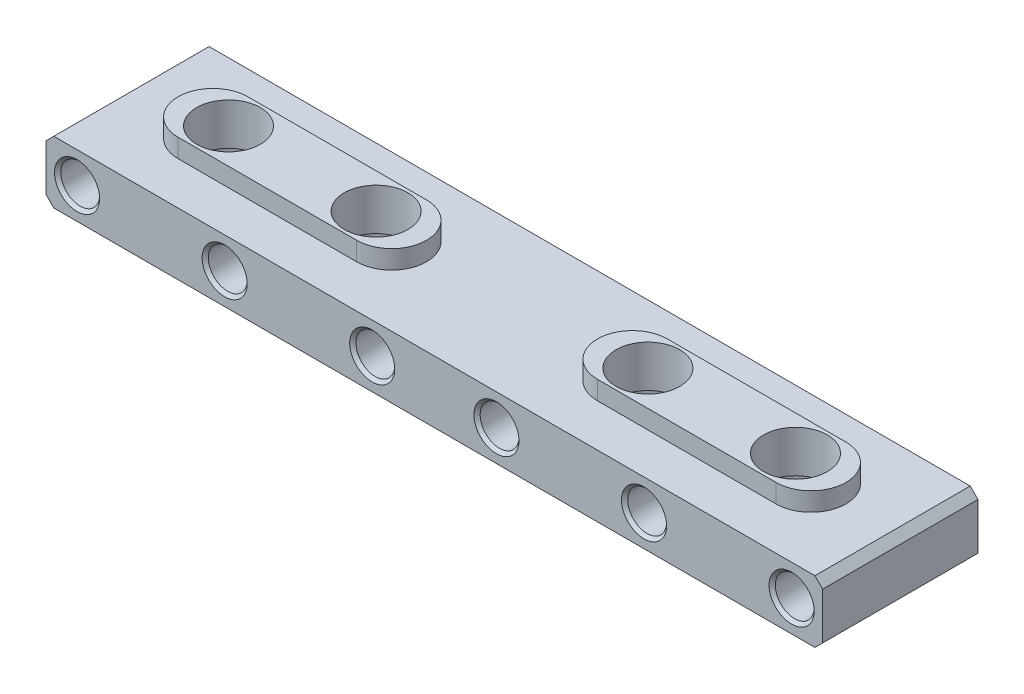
ISO-10303-21;
HEADER;
FILE_DESCRIPTION(('STEP AP214'),'2;1');
FILE_NAME('part.step','',(''),(''),'','','');
FILE_SCHEMA(('AUTOMOTIVE_DESIGN { 1 0 10303 214 1 1 1 1 }'));
ENDSEC;
DATA;
#1=APPLICATION_CONTEXT('core data for automotive mechanical design processes');
#2=APPLICATION_PROTOCOL_DEFINITION('international standard','automotive_design',2000,#1);
#3=PRODUCT_CONTEXT('',#1,'mechanical');
#4=PRODUCT('Part','Part','',(#3));
#5=PRODUCT_RELATED_PRODUCT_CATEGORY('part','',(#4));
#6=PRODUCT_DEFINITION_FORMATION('','',#4);
#7=PRODUCT_DEFINITION_CONTEXT('part definition',#1,'design');
#8=PRODUCT_DEFINITION('design','',#6,#7);
#9=PRODUCT_DEFINITION_SHAPE('','',#8);
#10=(LENGTH_UNIT() NAMED_UNIT(*) SI_UNIT(.MILLI.,.METRE.));
#11=(NAMED_UNIT(*) PLANE_ANGLE_UNIT() SI_UNIT($,.RADIAN.));
#12=(NAMED_UNIT(*) SI_UNIT($,.STERADIAN.) SOLID_ANGLE_UNIT());
#13=UNCERTAINTY_MEASURE_WITH_UNIT(LENGTH_MEASURE(1.E-05),#10,'distance_accuracy_value','');
#14=(GEOMETRIC_REPRESENTATION_CONTEXT(3) GLOBAL_UNCERTAINTY_ASSIGNED_CONTEXT((#13)) GLOBAL_UNIT_ASSIGNED_CONTEXT((#10,
#11,#12)) REPRESENTATION_CONTEXT('',''));
#15=CARTESIAN_POINT('',(0.,0.,0.));
#16=DIRECTION('',(0.,0.,1.));
#17=DIRECTION('',(1.,0.,0.));
#18=AXIS2_PLACEMENT_3D('',#15,#16,#17);
#19=CARTESIAN_POINT('',(-38.5,10.4,0.));
#20=DIRECTION('',(0.,1.,0.));
#21=DIRECTION('',(0.,0.,1.));
#22=AXIS2_PLACEMENT_3D('',#19,#20,#21);
#23=PLANE('',#22);
#24=CARTESIAN_POINT('',(-17.5,10.4,0.));
#25=DIRECTION('',(0.,-1.,0.));
#26=DIRECTION('',(0.,0.,-1.));
#27=AXIS2_PLACEMENT_3D('',#24,#25,#26);
#28=CIRCLE('',#27,4.1);
#29=CARTESIAN_POINT('',(-17.5,10.4,-4.1));
#30=VERTEX_POINT('',#29);
#31=EDGE_CURVE('E533',#30,#30,#28,.T.);
#32=ORIENTED_EDGE('',*,*,#31,.T.);
#33=EDGE_LOOP('',(#32));
#34=FACE_BOUND('',#33,.T.);
#35=CARTESIAN_POINT('',(-38.5,10.4,0.));
#36=DIRECTION('',(0.,1.,0.));
#37=DIRECTION('',(0.,0.,1.));
#38=AXIS2_PLACEMENT_3D('',#35,#36,#37);
#39=CIRCLE('',#38,4.5);
#40=CARTESIAN_POINT('',(-38.5,10.4,-4.5));
#41=VERTEX_POINT('',#40);
#42=CARTESIAN_POINT('',(-38.5,10.4,4.5));
#43=VERTEX_POINT('',#42);
#44=EDGE_CURVE('E162',#41,#43,#39,.T.);
#45=ORIENTED_EDGE('',*,*,#44,.T.);
#46=DIRECTION('',(1.,0.,0.));
#47=VECTOR('',#46,1.);
#48=CARTESIAN_POINT('',(-38.5,10.4,4.5));
#49=LINE('',#48,#47);
#50=CARTESIAN_POINT('',(-15.5,10.4,4.5));
#51=VERTEX_POINT('',#50);
#52=EDGE_CURVE('E135',#43,#51,#49,.T.);
#53=ORIENTED_EDGE('',*,*,#52,.T.);
#54=CARTESIAN_POINT('',(-15.5,10.4,0.));
#55=DIRECTION('',(0.,1.,0.));
#56=DIRECTION('',(0.,0.,1.));
#57=AXIS2_PLACEMENT_3D('',#54,#55,#56);
#58=CIRCLE('',#57,4.5);
#59=CARTESIAN_POINT('',(-15.5,10.4,-4.5));
#60=VERTEX_POINT('',#59);
#61=EDGE_CURVE('E165',#51,#60,#58,.T.);
#62=ORIENTED_EDGE('',*,*,#61,.T.);
#63=DIRECTION('',(-1.,0.,0.));
#64=VECTOR('',#63,1.);
#65=CARTESIAN_POINT('',(-38.5,10.4,-4.5));
#66=LINE('',#65,#64);
#67=EDGE_CURVE('E167',#60,#41,#66,.T.);
#68=ORIENTED_EDGE('',*,*,#67,.T.);
#69=EDGE_LOOP('',(#45,#53,#62,#68));
#70=FACE_BOUND('',#69,.T.);
#71=CARTESIAN_POINT('',(-36.5,10.4,0.));
#72=DIRECTION('',(0.,-1.,0.));
#73=DIRECTION('',(0.,0.,-1.));
#74=AXIS2_PLACEMENT_3D('',#71,#72,#73);
#75=CIRCLE('',#74,4.1);
#76=CARTESIAN_POINT('',(-36.5,10.4,-4.1));
#77=VERTEX_POINT('',#76);
#78=EDGE_CURVE('E519',#77,#77,#75,.T.);
#79=ORIENTED_EDGE('',*,*,#78,.T.);
#80=EDGE_LOOP('',(#79));
#81=FACE_BOUND('',#80,.T.);
#82=ADVANCED_FACE('F14',(#34,#70,#81),#23,.T.);
#83=CARTESIAN_POINT('',(-50.,8.,10.));
#84=DIRECTION('',(0.,1.,0.));
#85=DIRECTION('',(0.,0.,1.));
#86=AXIS2_PLACEMENT_3D('',#83,#84,#85);
#87=PLANE('',#86);
#88=DIRECTION('',(-1.,0.,0.));
#89=VECTOR('',#88,1.);
#90=CARTESIAN_POINT('',(38.5,8.,-4.5));
#91=LINE('',#90,#89);
#92=CARTESIAN_POINT('',(38.5,8.,-4.5));
#93=VERTEX_POINT('',#92);
#94=CARTESIAN_POINT('',(15.5,8.,-4.5));
#95=VERTEX_POINT('',#94);
#96=EDGE_CURVE('E175',#93,#95,#91,.T.);
#97=ORIENTED_EDGE('',*,*,#96,.F.);
#98=CARTESIAN_POINT('',(38.5,8.,0.));
#99=DIRECTION('',(0.,1.,0.));
#100=DIRECTION('',(0.,0.,-1.));
#101=AXIS2_PLACEMENT_3D('',#98,#99,#100);
#102=CIRCLE('',#101,4.5);
#103=CARTESIAN_POINT('',(38.5,8.,4.5));
#104=VERTEX_POINT('',#103);
#105=EDGE_CURVE('E139',#104,#93,#102,.T.);
#106=ORIENTED_EDGE('',*,*,#105,.F.);
#107=DIRECTION('',(1.,0.,0.));
#108=VECTOR('',#107,1.);
#109=CARTESIAN_POINT('',(38.5,8.,4.5));
#110=LINE('',#109,#108);
#111=CARTESIAN_POINT('',(15.5,8.,4.5));
#112=VERTEX_POINT('',#111);
#113=EDGE_CURVE('E180',#112,#104,#110,.T.);
#114=ORIENTED_EDGE('',*,*,#113,.F.);
#115=CARTESIAN_POINT('',(15.5,8.,0.));
#116=DIRECTION('',(0.,1.,0.));
#117=DIRECTION('',(0.,0.,-1.));
#118=AXIS2_PLACEMENT_3D('',#115,#116,#117);
#119=CIRCLE('',#118,4.5);
#120=EDGE_CURVE('E177',#95,#112,#119,.T.);
#121=ORIENTED_EDGE('',*,*,#120,.F.);
#122=EDGE_LOOP('',(#97,#106,#114,#121));
#123=FACE_BOUND('',#122,.T.);
#124=DIRECTION('',(-1.,0.,0.));
#125=VECTOR('',#124,1.);
#126=CARTESIAN_POINT('',(-50.,8.,-10.));
#127=LINE('',#126,#125);
#128=CARTESIAN_POINT('',(49.,8.,-10.));
#129=VERTEX_POINT('',#128);
#130=CARTESIAN_POINT('',(-49.,8.,-10.));
#131=VERTEX_POINT('',#130);
#132=EDGE_CURVE('E210',#129,#131,#127,.T.);
#133=ORIENTED_EDGE('',*,*,#132,.T.);
#134=DIRECTION('',(0.,0.,1.));
#135=VECTOR('',#134,1.);
#136=CARTESIAN_POINT('',(-49.,8.,10.));
#137=LINE('',#136,#135);
#138=CARTESIAN_POINT('',(-49.,8.,10.));
#139=VERTEX_POINT('',#138);
#140=EDGE_CURVE('E250',#131,#139,#137,.T.);
#141=ORIENTED_EDGE('',*,*,#140,.T.);
#142=DIRECTION('',(1.,0.,0.));
#143=VECTOR('',#142,1.);
#144=CARTESIAN_POINT('',(-50.,8.,10.));
#145=LINE('',#144,#143);
#146=CARTESIAN_POINT('',(49.,8.,10.));
#147=VERTEX_POINT('',#146);
#148=EDGE_CURVE('E207',#139,#147,#145,.T.);
#149=ORIENTED_EDGE('',*,*,#148,.T.);
#150=DIRECTION('',(0.,0.,-1.));
#151=VECTOR('',#150,1.);
#152=CARTESIAN_POINT('',(49.,8.,-10.));
#153=LINE('',#152,#151);
#154=EDGE_CURVE('E247',#147,#129,#153,.T.);
#155=ORIENTED_EDGE('',*,*,#154,.T.);
#156=EDGE_LOOP('',(#133,#141,#149,#155));
#157=FACE_BOUND('',#156,.T.);
#158=DIRECTION('',(1.,0.,0.));
#159=VECTOR('',#158,1.);
#160=CARTESIAN_POINT('',(-38.5,8.,4.5));
#161=LINE('',#160,#159);
#162=CARTESIAN_POINT('',(-38.5,8.,4.5));
#163=VERTEX_POINT('',#162);
#164=CARTESIAN_POINT('',(-15.5,8.,4.5));
#165=VERTEX_POINT('',#164);
#166=EDGE_CURVE('E133',#163,#165,#161,.T.);
#167=ORIENTED_EDGE('',*,*,#166,.F.);
#168=CARTESIAN_POINT('',(-38.5,8.,0.));
#169=DIRECTION('',(0.,1.,0.));
#170=DIRECTION('',(0.,0.,1.));
#171=AXIS2_PLACEMENT_3D('',#168,#169,#170);
#172=CIRCLE('',#171,4.5);
#173=CARTESIAN_POINT('',(-38.5,8.,-4.5));
#174=VERTEX_POINT('',#173);
#175=EDGE_CURVE('E144',#174,#163,#172,.T.);
#176=ORIENTED_EDGE('',*,*,#175,.F.);
#177=DIRECTION('',(-1.,0.,0.));
#178=VECTOR('',#177,1.);
#179=CARTESIAN_POINT('',(-38.5,8.,-4.5));
#180=LINE('',#179,#178);
#181=CARTESIAN_POINT('',(-15.5,8.,-4.5));
#182=VERTEX_POINT('',#181);
#183=EDGE_CURVE('E157',#182,#174,#180,.T.);
#184=ORIENTED_EDGE('',*,*,#183,.F.);
#185=CARTESIAN_POINT('',(-15.5,8.,0.));
#186=DIRECTION('',(0.,1.,0.));
#187=DIRECTION('',(0.,0.,1.));
#188=AXIS2_PLACEMENT_3D('',#185,#186,#187);
#189=CIRCLE('',#188,4.5);
#190=EDGE_CURVE('E155',#165,#182,#189,.T.);
#191=ORIENTED_EDGE('',*,*,#190,.F.);
#192=EDGE_LOOP('',(#167,#176,#184,#191));
#193=FACE_BOUND('',#192,.T.);
#194=ADVANCED_FACE('F153',(#123,#157,#193),#87,.T.);
#195=CARTESIAN_POINT('',(-50.,8.,-10.));
#196=DIRECTION('',(1.,0.,0.));
#197=DIRECTION('',(0.,0.,-1.));
#198=AXIS2_PLACEMENT_3D('',#195,#196,#197);
#199=PLANE('',#198);
#200=DIRECTION('',(0.,-1.,0.));
#201=VECTOR('',#200,1.);
#202=CARTESIAN_POINT('',(-50.,8.,-10.));
#203=LINE('',#202,#201);
#204=CARTESIAN_POINT('',(-50.,7.,-10.));
#205=VERTEX_POINT('',#204);
#206=CARTESIAN_POINT('',(-50.,1.00000000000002,-10.));
#207=VERTEX_POINT('',#206);
#208=EDGE_CURVE('E213',#205,#207,#203,.T.);
#209=ORIENTED_EDGE('',*,*,#208,.T.);
#210=DIRECTION('',(0.,0.,1.));
#211=VECTOR('',#210,1.);
#212=CARTESIAN_POINT('',(-50.,1.00000000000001,-10.));
#213=LINE('',#212,#211);
#214=CARTESIAN_POINT('',(-50.,1.00000000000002,10.));
#215=VERTEX_POINT('',#214);
#216=EDGE_CURVE('E226',#207,#215,#213,.T.);
#217=ORIENTED_EDGE('',*,*,#216,.T.);
#218=DIRECTION('',(0.,-1.,0.));
#219=VECTOR('',#218,1.);
#220=CARTESIAN_POINT('',(-50.,8.,10.));
#221=LINE('',#220,#219);
#222=CARTESIAN_POINT('',(-50.,7.,10.));
#223=VERTEX_POINT('',#222);
#224=EDGE_CURVE('E221',#223,#215,#221,.T.);
#225=ORIENTED_EDGE('',*,*,#224,.F.);
#226=DIRECTION('',(0.,0.,-1.));
#227=VECTOR('',#226,1.);
#228=CARTESIAN_POINT('',(-50.,7.,-10.));
#229=LINE('',#228,#227);
#230=EDGE_CURVE('E224',#223,#205,#229,.T.);
#231=ORIENTED_EDGE('',*,*,#230,.T.);
#232=EDGE_LOOP('',(#209,#217,#225,#231));
#233=FACE_BOUND('',#232,.T.);
#234=ADVANCED_FACE('F16',(#233),#199,.F.);
#235=CARTESIAN_POINT('',(-50.,8.,10.));
#236=DIRECTION('',(0.,0.,-1.));
#237=DIRECTION('',(-1.,0.,0.));
#238=AXIS2_PLACEMENT_3D('',#235,#236,#237);
#239=PLANE('',#238);
#240=CARTESIAN_POINT('',(-46.,4.,10.));
#241=DIRECTION('',(0.,0.,-1.));
#242=DIRECTION('',(-1.,0.,0.));
#243=AXIS2_PLACEMENT_3D('',#240,#241,#242);
#244=CIRCLE('',#243,2.9);
#245=CARTESIAN_POINT('',(-48.9,4.,10.));
#246=VERTEX_POINT('',#245);
#247=EDGE_CURVE('E272',#246,#246,#244,.T.);
#248=ORIENTED_EDGE('',*,*,#247,.T.);
#249=EDGE_LOOP('',(#248));
#250=FACE_BOUND('',#249,.T.);
#251=CARTESIAN_POINT('',(-27.,4.,10.));
#252=DIRECTION('',(0.,0.,-1.));
#253=DIRECTION('',(-1.,0.,0.));
#254=AXIS2_PLACEMENT_3D('',#251,#252,#253);
#255=CIRCLE('',#254,2.9);
#256=CARTESIAN_POINT('',(-29.9,4.,10.));
#257=VERTEX_POINT('',#256);
#258=EDGE_CURVE('E269',#257,#257,#255,.T.);
#259=ORIENTED_EDGE('',*,*,#258,.T.);
#260=EDGE_LOOP('',(#259));
#261=FACE_BOUND('',#260,.T.);
#262=CARTESIAN_POINT('',(-8.,4.,10.));
#263=DIRECTION('',(0.,0.,-1.));
#264=DIRECTION('',(-1.,0.,0.));
#265=AXIS2_PLACEMENT_3D('',#262,#263,#264);
#266=CIRCLE('',#265,2.9);
#267=CARTESIAN_POINT('',(-10.9,4.,10.));
#268=VERTEX_POINT('',#267);
#269=EDGE_CURVE('E266',#268,#268,#266,.T.);
#270=ORIENTED_EDGE('',*,*,#269,.T.);
#271=EDGE_LOOP('',(#270));
#272=FACE_BOUND('',#271,.T.);
#273=CARTESIAN_POINT('',(8.,4.,10.));
#274=DIRECTION('',(0.,0.,-1.));
#275=DIRECTION('',(-1.,0.,0.));
#276=AXIS2_PLACEMENT_3D('',#273,#274,#275);
#277=CIRCLE('',#276,2.9);
#278=CARTESIAN_POINT('',(5.1,4.,10.));
#279=VERTEX_POINT('',#278);
#280=EDGE_CURVE('E263',#279,#279,#277,.T.);
#281=ORIENTED_EDGE('',*,*,#280,.T.);
#282=EDGE_LOOP('',(#281));
#283=FACE_BOUND('',#282,.T.);
#284=CARTESIAN_POINT('',(27.,4.,10.));
#285=DIRECTION('',(0.,0.,-1.));
#286=DIRECTION('',(-1.,0.,0.));
#287=AXIS2_PLACEMENT_3D('',#284,#285,#286);
#288=CIRCLE('',#287,2.9);
#289=CARTESIAN_POINT('',(24.1,4.,10.));
#290=VERTEX_POINT('',#289);
#291=EDGE_CURVE('E260',#290,#290,#288,.T.);
#292=ORIENTED_EDGE('',*,*,#291,.T.);
#293=EDGE_LOOP('',(#292));
#294=FACE_BOUND('',#293,.T.);
#295=CARTESIAN_POINT('',(46.,4.,10.));
#296=DIRECTION('',(0.,0.,-1.));
#297=DIRECTION('',(-1.,0.,0.));
#298=AXIS2_PLACEMENT_3D('',#295,#296,#297);
#299=CIRCLE('',#298,2.9);
#300=CARTESIAN_POINT('',(43.1,4.,10.));
#301=VERTEX_POINT('',#300);
#302=EDGE_CURVE('E257',#301,#301,#299,.T.);
#303=ORIENTED_EDGE('',*,*,#302,.T.);
#304=EDGE_LOOP('',(#303));
#305=FACE_BOUND('',#304,.T.);
#306=ORIENTED_EDGE('',*,*,#224,.T.);
#307=DIRECTION('',(-0.707106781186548,0.707106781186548,0.));
#308=VECTOR('',#307,1.);
#309=CARTESIAN_POINT('',(-50.,1.00000000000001,10.));
#310=LINE('',#309,#308);
#311=CARTESIAN_POINT('',(-49.,0.,10.));
#312=VERTEX_POINT('',#311);
#313=EDGE_CURVE('E235',#215,#312,#310,.F.);
#314=ORIENTED_EDGE('',*,*,#313,.T.);
#315=DIRECTION('',(1.,0.,0.));
#316=VECTOR('',#315,1.);
#317=CARTESIAN_POINT('',(-50.,0.,10.));
#318=LINE('',#317,#316);
#319=CARTESIAN_POINT('',(49.,0.,10.));
#320=VERTEX_POINT('',#319);
#321=EDGE_CURVE('E201',#312,#320,#318,.T.);
#322=ORIENTED_EDGE('',*,*,#321,.T.);
#323=DIRECTION('',(-0.707106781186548,-0.707106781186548,0.));
#324=VECTOR('',#323,1.);
#325=CARTESIAN_POINT('',(50.,1.00000000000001,10.));
#326=LINE('',#325,#324);
#327=CARTESIAN_POINT('',(50.,1.00000000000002,10.));
#328=VERTEX_POINT('',#327);
#329=EDGE_CURVE('E231',#320,#328,#326,.F.);
#330=ORIENTED_EDGE('',*,*,#329,.T.);
#331=DIRECTION('',(0.,-1.,0.));
#332=VECTOR('',#331,1.);
#333=CARTESIAN_POINT('',(50.,8.,10.));
#334=LINE('',#333,#332);
#335=CARTESIAN_POINT('',(50.,7.,10.));
#336=VERTEX_POINT('',#335);
#337=EDGE_CURVE('E218',#336,#328,#334,.T.);
#338=ORIENTED_EDGE('',*,*,#337,.F.);
#339=DIRECTION('',(-0.707106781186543,0.707106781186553,0.));
#340=VECTOR('',#339,1.);
#341=CARTESIAN_POINT('',(49.,8.,10.));
#342=LINE('',#341,#340);
#343=EDGE_CURVE('E229',#336,#147,#342,.T.);
#344=ORIENTED_EDGE('',*,*,#343,.T.);
#345=ORIENTED_EDGE('',*,*,#148,.F.);
#346=DIRECTION('',(-0.707106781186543,-0.707106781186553,0.));
#347=VECTOR('',#346,1.);
#348=CARTESIAN_POINT('',(-49.,8.,10.));
#349=LINE('',#348,#347);
#350=EDGE_CURVE('E233',#139,#223,#349,.T.);
#351=ORIENTED_EDGE('',*,*,#350,.T.);
#352=EDGE_LOOP('',(#306,#314,#322,#330,#338,#344,#345,#351));
#353=FACE_BOUND('',#352,.T.);
#354=ADVANCED_FACE('F424',(#250,#261,#272,#283,#294,#305,#353),#239,.F.);
#355=CARTESIAN_POINT('',(50.,8.,-10.));
#356=DIRECTION('',(-1.,0.,0.));
#357=DIRECTION('',(0.,0.,1.));
#358=AXIS2_PLACEMENT_3D('',#355,#356,#357);
#359=PLANE('',#358);
#360=ORIENTED_EDGE('',*,*,#337,.T.);
#361=DIRECTION('',(0.,0.,-1.));
#362=VECTOR('',#361,1.);
#363=CARTESIAN_POINT('',(50.,1.00000000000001,-10.));
#364=LINE('',#363,#362);
#365=CARTESIAN_POINT('',(50.,1.00000000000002,-10.));
#366=VERTEX_POINT('',#365);
#367=EDGE_CURVE('E255',#328,#366,#364,.T.);
#368=ORIENTED_EDGE('',*,*,#367,.T.);
#369=DIRECTION('',(0.,-1.,0.));
#370=VECTOR('',#369,1.);
#371=CARTESIAN_POINT('',(50.,8.,-10.));
#372=LINE('',#371,#370);
#373=CARTESIAN_POINT('',(50.,7.,-10.));
#374=VERTEX_POINT('',#373);
#375=EDGE_CURVE('E216',#374,#366,#372,.T.);
#376=ORIENTED_EDGE('',*,*,#375,.F.);
#377=DIRECTION('',(0.,0.,1.));
#378=VECTOR('',#377,1.);
#379=CARTESIAN_POINT('',(50.,7.,10.));
#380=LINE('',#379,#378);
#381=EDGE_CURVE('E253',#374,#336,#380,.T.);
#382=ORIENTED_EDGE('',*,*,#381,.T.);
#383=EDGE_LOOP('',(#360,#368,#376,#382));
#384=FACE_BOUND('',#383,.T.);
#385=ADVANCED_FACE('F441',(#384),#359,.F.);
#386=CARTESIAN_POINT('',(-50.,8.,-10.));
#387=DIRECTION('',(0.,0.,1.));
#388=DIRECTION('',(1.,0.,0.));
#389=AXIS2_PLACEMENT_3D('',#386,#387,#388);
#390=PLANE('',#389);
#391=CARTESIAN_POINT('',(46.,4.,-10.));
#392=DIRECTION('',(0.,0.,1.));
#393=DIRECTION('',(1.,0.,0.));
#394=AXIS2_PLACEMENT_3D('',#391,#392,#393);
#395=CIRCLE('',#394,2.9);
#396=CARTESIAN_POINT('',(48.9,4.,-10.));
#397=VERTEX_POINT('',#396);
#398=EDGE_CURVE('E9',#397,#397,#395,.T.);
#399=ORIENTED_EDGE('',*,*,#398,.T.);
#400=EDGE_LOOP('',(#399));
#401=FACE_BOUND('',#400,.T.);
#402=CARTESIAN_POINT('',(27.,4.,-10.));
#403=DIRECTION('',(0.,0.,1.));
#404=DIRECTION('',(1.,0.,0.));
#405=AXIS2_PLACEMENT_3D('',#402,#403,#404);
#406=CIRCLE('',#405,2.9);
#407=CARTESIAN_POINT('',(29.9,4.,-10.));
#408=VERTEX_POINT('',#407);
#409=EDGE_CURVE('E22',#408,#408,#406,.T.);
#410=ORIENTED_EDGE('',*,*,#409,.T.);
#411=EDGE_LOOP('',(#410));
#412=FACE_BOUND('',#411,.T.);
#413=CARTESIAN_POINT('',(8.,4.,-10.));
#414=DIRECTION('',(0.,0.,1.));
#415=DIRECTION('',(1.,0.,0.));
#416=AXIS2_PLACEMENT_3D('',#413,#414,#415);
#417=CIRCLE('',#416,2.9);
#418=CARTESIAN_POINT('',(10.9,4.,-10.));
#419=VERTEX_POINT('',#418);
#420=EDGE_CURVE('E320',#419,#419,#417,.T.);
#421=ORIENTED_EDGE('',*,*,#420,.T.);
#422=EDGE_LOOP('',(#421));
#423=FACE_BOUND('',#422,.T.);
#424=CARTESIAN_POINT('',(-8.,4.,-10.));
#425=DIRECTION('',(0.,0.,1.));
#426=DIRECTION('',(1.,0.,0.));
#427=AXIS2_PLACEMENT_3D('',#424,#425,#426);
#428=CIRCLE('',#427,2.9);
#429=CARTESIAN_POINT('',(-5.1,4.,-10.));
#430=VERTEX_POINT('',#429);
#431=EDGE_CURVE('E317',#430,#430,#428,.T.);
#432=ORIENTED_EDGE('',*,*,#431,.T.);
#433=EDGE_LOOP('',(#432));
#434=FACE_BOUND('',#433,.T.);
#435=CARTESIAN_POINT('',(-27.,4.,-10.));
#436=DIRECTION('',(0.,0.,1.));
#437=DIRECTION('',(1.,0.,0.));
#438=AXIS2_PLACEMENT_3D('',#435,#436,#437);
#439=CIRCLE('',#438,2.9);
#440=CARTESIAN_POINT('',(-24.1,4.,-10.));
#441=VERTEX_POINT('',#440);
#442=EDGE_CURVE('E314',#441,#441,#439,.T.);
#443=ORIENTED_EDGE('',*,*,#442,.T.);
#444=EDGE_LOOP('',(#443));
#445=FACE_BOUND('',#444,.T.);
#446=CARTESIAN_POINT('',(-46.,4.,-10.));
#447=DIRECTION('',(0.,0.,1.));
#448=DIRECTION('',(1.,0.,0.));
#449=AXIS2_PLACEMENT_3D('',#446,#447,#448);
#450=CIRCLE('',#449,2.9);
#451=CARTESIAN_POINT('',(-43.1,4.,-10.));
#452=VERTEX_POINT('',#451);
#453=EDGE_CURVE('E311',#452,#452,#450,.T.);
#454=ORIENTED_EDGE('',*,*,#453,.T.);
#455=EDGE_LOOP('',(#454));
#456=FACE_BOUND('',#455,.T.);
#457=DIRECTION('',(-1.,0.,0.));
#458=VECTOR('',#457,1.);
#459=CARTESIAN_POINT('',(-50.,0.,-10.));
#460=LINE('',#459,#458);
#461=CARTESIAN_POINT('',(49.,0.,-10.));
#462=VERTEX_POINT('',#461);
#463=CARTESIAN_POINT('',(-49.,0.,-10.));
#464=VERTEX_POINT('',#463);
#465=EDGE_CURVE('E204',#462,#464,#460,.T.);
#466=ORIENTED_EDGE('',*,*,#465,.T.);
#467=DIRECTION('',(0.707106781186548,-0.707106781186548,0.));
#468=VECTOR('',#467,1.);
#469=CARTESIAN_POINT('',(-50.,1.00000000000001,-10.));
#470=LINE('',#469,#468);
#471=EDGE_CURVE('E245',#464,#207,#470,.F.);
#472=ORIENTED_EDGE('',*,*,#471,.T.);
#473=ORIENTED_EDGE('',*,*,#208,.F.);
#474=DIRECTION('',(0.707106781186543,0.707106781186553,0.));
#475=VECTOR('',#474,1.);
#476=CARTESIAN_POINT('',(-49.,8.,-10.));
#477=LINE('',#476,#475);
#478=EDGE_CURVE('E243',#205,#131,#477,.T.);
#479=ORIENTED_EDGE('',*,*,#478,.T.);
#480=ORIENTED_EDGE('',*,*,#132,.F.);
#481=DIRECTION('',(0.707106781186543,-0.707106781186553,0.));
#482=VECTOR('',#481,1.);
#483=CARTESIAN_POINT('',(49.,8.,-10.));
#484=LINE('',#483,#482);
#485=EDGE_CURVE('E37',#129,#374,#484,.T.);
#486=ORIENTED_EDGE('',*,*,#485,.T.);
#487=ORIENTED_EDGE('',*,*,#375,.T.);
#488=DIRECTION('',(0.707106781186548,0.707106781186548,0.));
#489=VECTOR('',#488,1.);
#490=CARTESIAN_POINT('',(50.,1.00000000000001,-10.));
#491=LINE('',#490,#489);
#492=EDGE_CURVE('E29',#366,#462,#491,.F.);
#493=ORIENTED_EDGE('',*,*,#492,.T.);
#494=EDGE_LOOP('',(#466,#472,#473,#479,#480,#486,#487,#493));
#495=FACE_BOUND('',#494,.T.);
#496=ADVANCED_FACE('F325',(#401,#412,#423,#434,#445,#456,#495),#390,.F.);
#497=CARTESIAN_POINT('',(-50.,0.,10.));
#498=DIRECTION('',(0.,1.,0.));
#499=DIRECTION('',(0.,0.,1.));
#500=AXIS2_PLACEMENT_3D('',#497,#498,#499);
#501=PLANE('',#500);
#502=CARTESIAN_POINT('',(36.5,0.,0.));
#503=DIRECTION('',(0.,-1.,0.));
#504=DIRECTION('',(0.,0.,-1.));
#505=AXIS2_PLACEMENT_3D('',#502,#503,#504);
#506=CIRCLE('',#505,6.75);
#507=CARTESIAN_POINT('',(36.5,0.,-6.75));
#508=VERTEX_POINT('',#507);
#509=EDGE_CURVE('E547',#508,#508,#506,.T.);
#510=ORIENTED_EDGE('',*,*,#509,.F.);
#511=EDGE_LOOP('',(#510));
#512=FACE_BOUND('',#511,.T.);
#513=CARTESIAN_POINT('',(17.5,0.,0.));
#514=DIRECTION('',(0.,-1.,0.));
#515=DIRECTION('',(0.,0.,-1.));
#516=AXIS2_PLACEMENT_3D('',#513,#514,#515);
#517=CIRCLE('',#516,6.75);
#518=CARTESIAN_POINT('',(17.5,0.,-6.75));
#519=VERTEX_POINT('',#518);
#520=EDGE_CURVE('E535',#519,#519,#517,.T.);
#521=ORIENTED_EDGE('',*,*,#520,.F.);
#522=EDGE_LOOP('',(#521));
#523=FACE_BOUND('',#522,.T.);
#524=CARTESIAN_POINT('',(-17.5,0.,0.));
#525=DIRECTION('',(0.,-1.,0.));
#526=DIRECTION('',(0.,0.,-1.));
#527=AXIS2_PLACEMENT_3D('',#524,#525,#526);
#528=CIRCLE('',#527,6.75);
#529=CARTESIAN_POINT('',(-17.5,0.,-6.75));
#530=VERTEX_POINT('',#529);
#531=EDGE_CURVE('E524',#530,#530,#528,.T.);
#532=ORIENTED_EDGE('',*,*,#531,.F.);
#533=EDGE_LOOP('',(#532));
#534=FACE_BOUND('',#533,.T.);
#535=CARTESIAN_POINT('',(-36.5,0.,0.));
#536=DIRECTION('',(0.,-1.,0.));
#537=DIRECTION('',(0.,0.,-1.));
#538=AXIS2_PLACEMENT_3D('',#535,#536,#537);
#539=CIRCLE('',#538,6.75);
#540=CARTESIAN_POINT('',(-36.5,0.,-6.75));
#541=VERTEX_POINT('',#540);
#542=EDGE_CURVE('E150',#541,#541,#539,.T.);
#543=ORIENTED_EDGE('',*,*,#542,.F.);
#544=EDGE_LOOP('',(#543));
#545=FACE_BOUND('',#544,.T.);
#546=ORIENTED_EDGE('',*,*,#321,.F.);
#547=DIRECTION('',(0.,0.,-1.));
#548=VECTOR('',#547,1.);
#549=CARTESIAN_POINT('',(-49.,0.,10.));
#550=LINE('',#549,#548);
#551=EDGE_CURVE('E239',#312,#464,#550,.T.);
#552=ORIENTED_EDGE('',*,*,#551,.T.);
#553=ORIENTED_EDGE('',*,*,#465,.F.);
#554=DIRECTION('',(0.,0.,1.));
#555=VECTOR('',#554,1.);
#556=CARTESIAN_POINT('',(49.,0.,10.));
#557=LINE('',#556,#555);
#558=EDGE_CURVE('E237',#462,#320,#557,.T.);
#559=ORIENTED_EDGE('',*,*,#558,.T.);
#560=EDGE_LOOP('',(#546,#552,#553,#559));
#561=FACE_BOUND('',#560,.T.);
#562=ADVANCED_FACE('F435',(#512,#523,#534,#545,#561),#501,.F.);
#563=CARTESIAN_POINT('',(-46.,4.,-10.));
#564=DIRECTION('',(0.,0.,-1.));
#565=DIRECTION('',(-1.,0.,0.));
#566=AXIS2_PLACEMENT_3D('',#563,#564,#565);
#567=CYLINDRICAL_SURFACE('',#566,2.5);
#568=CARTESIAN_POINT('',(-46.,4.,9.6));
#569=DIRECTION('',(0.,0.,-1.));
#570=DIRECTION('',(-1.,0.,0.));
#571=AXIS2_PLACEMENT_3D('',#568,#569,#570);
#572=CIRCLE('',#571,2.5);
#573=CARTESIAN_POINT('',(-48.5,4.,9.6));
#574=VERTEX_POINT('',#573);
#575=EDGE_CURVE('E278',#574,#574,#572,.F.);
#576=ORIENTED_EDGE('',*,*,#575,.T.);
#577=EDGE_LOOP('',(#576));
#578=FACE_BOUND('',#577,.T.);
#579=CARTESIAN_POINT('',(-46.,4.,-9.6));
#580=DIRECTION('',(0.,0.,1.));
#581=DIRECTION('',(1.,0.,0.));
#582=AXIS2_PLACEMENT_3D('',#579,#580,#581);
#583=CIRCLE('',#582,2.5);
#584=CARTESIAN_POINT('',(-43.5,4.,-9.6));
#585=VERTEX_POINT('',#584);
#586=EDGE_CURVE('E275',#585,#585,#583,.F.);
#587=ORIENTED_EDGE('',*,*,#586,.T.);
#588=EDGE_LOOP('',(#587));
#589=FACE_BOUND('',#588,.T.);
#590=ADVANCED_FACE('F569',(#578,#589),#567,.F.);
#591=CARTESIAN_POINT('',(-27.,4.,-10.));
#592=DIRECTION('',(0.,0.,-1.));
#593=DIRECTION('',(-1.,0.,0.));
#594=AXIS2_PLACEMENT_3D('',#591,#592,#593);
#595=CYLINDRICAL_SURFACE('',#594,2.5);
#596=CARTESIAN_POINT('',(-27.,4.,9.6));
#597=DIRECTION('',(0.,0.,-1.));
#598=DIRECTION('',(-1.,0.,0.));
#599=AXIS2_PLACEMENT_3D('',#596,#597,#598);
#600=CIRCLE('',#599,2.5);
#601=CARTESIAN_POINT('',(-29.5,4.,9.6));
#602=VERTEX_POINT('',#601);
#603=EDGE_CURVE('E284',#602,#602,#600,.F.);
#604=ORIENTED_EDGE('',*,*,#603,.T.);
#605=EDGE_LOOP('',(#604));
#606=FACE_BOUND('',#605,.T.);
#607=CARTESIAN_POINT('',(-27.,4.,-9.6));
#608=DIRECTION('',(0.,0.,1.));
#609=DIRECTION('',(1.,0.,0.));
#610=AXIS2_PLACEMENT_3D('',#607,#608,#609);
#611=CIRCLE('',#610,2.5);
#612=CARTESIAN_POINT('',(-24.5,4.,-9.6));
#613=VERTEX_POINT('',#612);
#614=EDGE_CURVE('E281',#613,#613,#611,.F.);
#615=ORIENTED_EDGE('',*,*,#614,.T.);
#616=EDGE_LOOP('',(#615));
#617=FACE_BOUND('',#616,.T.);
#618=ADVANCED_FACE('F584',(#606,#617),#595,.F.);
#619=CARTESIAN_POINT('',(-8.,4.,-10.));
#620=DIRECTION('',(0.,0.,-1.));
#621=DIRECTION('',(-1.,0.,0.));
#622=AXIS2_PLACEMENT_3D('',#619,#620,#621);
#623=CYLINDRICAL_SURFACE('',#622,2.5);
#624=CARTESIAN_POINT('',(-8.,4.,9.6));
#625=DIRECTION('',(0.,0.,-1.));
#626=DIRECTION('',(-1.,0.,0.));
#627=AXIS2_PLACEMENT_3D('',#624,#625,#626);
#628=CIRCLE('',#627,2.5);
#629=CARTESIAN_POINT('',(-10.5,4.,9.6));
#630=VERTEX_POINT('',#629);
#631=EDGE_CURVE('E290',#630,#630,#628,.F.);
#632=ORIENTED_EDGE('',*,*,#631,.T.);
#633=EDGE_LOOP('',(#632));
#634=FACE_BOUND('',#633,.T.);
#635=CARTESIAN_POINT('',(-8.,4.,-9.6));
#636=DIRECTION('',(0.,0.,1.));
#637=DIRECTION('',(1.,0.,0.));
#638=AXIS2_PLACEMENT_3D('',#635,#636,#637);
#639=CIRCLE('',#638,2.5);
#640=CARTESIAN_POINT('',(-5.5,4.,-9.6));
#641=VERTEX_POINT('',#640);
#642=EDGE_CURVE('E287',#641,#641,#639,.F.);
#643=ORIENTED_EDGE('',*,*,#642,.T.);
#644=EDGE_LOOP('',(#643));
#645=FACE_BOUND('',#644,.T.);
#646=ADVANCED_FACE('F351',(#634,#645),#623,.F.);
#647=CARTESIAN_POINT('',(8.,4.,-10.));
#648=DIRECTION('',(0.,0.,-1.));
#649=DIRECTION('',(-1.,0.,0.));
#650=AXIS2_PLACEMENT_3D('',#647,#648,#649);
#651=CYLINDRICAL_SURFACE('',#650,2.5);
#652=CARTESIAN_POINT('',(8.,4.,9.6));
#653=DIRECTION('',(0.,0.,-1.));
#654=DIRECTION('',(-1.,0.,0.));
#655=AXIS2_PLACEMENT_3D('',#652,#653,#654);
#656=CIRCLE('',#655,2.5);
#657=CARTESIAN_POINT('',(5.5,4.,9.6));
#658=VERTEX_POINT('',#657);
#659=EDGE_CURVE('E296',#658,#658,#656,.F.);
#660=ORIENTED_EDGE('',*,*,#659,.T.);
#661=EDGE_LOOP('',(#660));
#662=FACE_BOUND('',#661,.T.);
#663=CARTESIAN_POINT('',(8.,4.,-9.6));
#664=DIRECTION('',(0.,0.,1.));
#665=DIRECTION('',(1.,0.,0.));
#666=AXIS2_PLACEMENT_3D('',#663,#664,#665);
#667=CIRCLE('',#666,2.5);
#668=CARTESIAN_POINT('',(10.5,4.,-9.6));
#669=VERTEX_POINT('',#668);
#670=EDGE_CURVE('E293',#669,#669,#667,.F.);
#671=ORIENTED_EDGE('',*,*,#670,.T.);
#672=EDGE_LOOP('',(#671));
#673=FACE_BOUND('',#672,.T.);
#674=ADVANCED_FACE('F339',(#662,#673),#651,.F.);
#675=CARTESIAN_POINT('',(27.,4.,-10.));
#676=DIRECTION('',(0.,0.,-1.));
#677=DIRECTION('',(-1.,0.,0.));
#678=AXIS2_PLACEMENT_3D('',#675,#676,#677);
#679=CYLINDRICAL_SURFACE('',#678,2.5);
#680=CARTESIAN_POINT('',(27.,4.,9.6));
#681=DIRECTION('',(0.,0.,-1.));
#682=DIRECTION('',(-1.,0.,0.));
#683=AXIS2_PLACEMENT_3D('',#680,#681,#682);
#684=CIRCLE('',#683,2.5);
#685=CARTESIAN_POINT('',(24.5,4.,9.6));
#686=VERTEX_POINT('',#685);
#687=EDGE_CURVE('E302',#686,#686,#684,.F.);
#688=ORIENTED_EDGE('',*,*,#687,.T.);
#689=EDGE_LOOP('',(#688));
#690=FACE_BOUND('',#689,.T.);
#691=CARTESIAN_POINT('',(27.,4.,-9.6));
#692=DIRECTION('',(0.,0.,1.));
#693=DIRECTION('',(1.,0.,0.));
#694=AXIS2_PLACEMENT_3D('',#691,#692,#693);
#695=CIRCLE('',#694,2.5);
#696=CARTESIAN_POINT('',(29.5,4.,-9.6));
#697=VERTEX_POINT('',#696);
#698=EDGE_CURVE('E299',#697,#697,#695,.F.);
#699=ORIENTED_EDGE('',*,*,#698,.T.);
#700=EDGE_LOOP('',(#699));
#701=FACE_BOUND('',#700,.T.);
#702=ADVANCED_FACE('F336',(#690,#701),#679,.F.);
#703=CARTESIAN_POINT('',(46.,4.,-10.));
#704=DIRECTION('',(0.,0.,-1.));
#705=DIRECTION('',(-1.,0.,0.));
#706=AXIS2_PLACEMENT_3D('',#703,#704,#705);
#707=CYLINDRICAL_SURFACE('',#706,2.5);
#708=CARTESIAN_POINT('',(46.,4.,9.6));
#709=DIRECTION('',(0.,0.,-1.));
#710=DIRECTION('',(-1.,0.,0.));
#711=AXIS2_PLACEMENT_3D('',#708,#709,#710);
#712=CIRCLE('',#711,2.5);
#713=CARTESIAN_POINT('',(43.5,4.,9.6));
#714=VERTEX_POINT('',#713);
#715=EDGE_CURVE('E308',#714,#714,#712,.F.);
#716=ORIENTED_EDGE('',*,*,#715,.T.);
#717=EDGE_LOOP('',(#716));
#718=FACE_BOUND('',#717,.T.);
#719=CARTESIAN_POINT('',(46.,4.,-9.6));
#720=DIRECTION('',(0.,0.,1.));
#721=DIRECTION('',(1.,0.,0.));
#722=AXIS2_PLACEMENT_3D('',#719,#720,#721);
#723=CIRCLE('',#722,2.5);
#724=CARTESIAN_POINT('',(48.5,4.,-9.6));
#725=VERTEX_POINT('',#724);
#726=EDGE_CURVE('E305',#725,#725,#723,.F.);
#727=ORIENTED_EDGE('',*,*,#726,.T.);
#728=EDGE_LOOP('',(#727));
#729=FACE_BOUND('',#728,.T.);
#730=ADVANCED_FACE('F338',(#718,#729),#707,.F.);
#731=CARTESIAN_POINT('',(38.5,10.4,0.));
#732=DIRECTION('',(0.,-1.,0.));
#733=DIRECTION('',(0.,0.,-1.));
#734=AXIS2_PLACEMENT_3D('',#731,#732,#733);
#735=CYLINDRICAL_SURFACE('',#734,4.5);
#736=ORIENTED_EDGE('',*,*,#105,.T.);
#737=DIRECTION('',(0.,-1.,0.));
#738=VECTOR('',#737,1.);
#739=CARTESIAN_POINT('',(38.5,10.4,-4.5));
#740=LINE('',#739,#738);
#741=CARTESIAN_POINT('',(38.5,10.4,-4.5));
#742=VERTEX_POINT('',#741);
#743=EDGE_CURVE('E199',#742,#93,#740,.T.);
#744=ORIENTED_EDGE('',*,*,#743,.F.);
#745=CARTESIAN_POINT('',(38.5,10.4,0.));
#746=DIRECTION('',(0.,1.,0.));
#747=DIRECTION('',(0.,0.,-1.));
#748=AXIS2_PLACEMENT_3D('',#745,#746,#747);
#749=CIRCLE('',#748,4.5);
#750=CARTESIAN_POINT('',(38.5,10.4,4.5));
#751=VERTEX_POINT('',#750);
#752=EDGE_CURVE('E182',#751,#742,#749,.T.);
#753=ORIENTED_EDGE('',*,*,#752,.F.);
#754=DIRECTION('',(0.,-1.,0.));
#755=VECTOR('',#754,1.);
#756=CARTESIAN_POINT('',(38.5,10.4,4.5));
#757=LINE('',#756,#755);
#758=EDGE_CURVE('E191',#751,#104,#757,.T.);
#759=ORIENTED_EDGE('',*,*,#758,.T.);
#760=EDGE_LOOP('',(#736,#744,#753,#759));
#761=FACE_BOUND('',#760,.T.);
#762=ADVANCED_FACE('F348',(#761),#735,.T.);
#763=CARTESIAN_POINT('',(38.5,10.4,-4.5));
#764=DIRECTION('',(0.,0.,1.));
#765=DIRECTION('',(1.,0.,0.));
#766=AXIS2_PLACEMENT_3D('',#763,#764,#765);
#767=PLANE('',#766);
#768=ORIENTED_EDGE('',*,*,#96,.T.);
#769=DIRECTION('',(0.,-1.,0.));
#770=VECTOR('',#769,1.);
#771=CARTESIAN_POINT('',(15.5,10.4,-4.5));
#772=LINE('',#771,#770);
#773=CARTESIAN_POINT('',(15.5,10.4,-4.5));
#774=VERTEX_POINT('',#773);
#775=EDGE_CURVE('E196',#774,#95,#772,.T.);
#776=ORIENTED_EDGE('',*,*,#775,.F.);
#777=DIRECTION('',(-1.,0.,0.));
#778=VECTOR('',#777,1.);
#779=CARTESIAN_POINT('',(38.5,10.4,-4.5));
#780=LINE('',#779,#778);
#781=EDGE_CURVE('E185',#742,#774,#780,.T.);
#782=ORIENTED_EDGE('',*,*,#781,.F.);
#783=ORIENTED_EDGE('',*,*,#743,.T.);
#784=EDGE_LOOP('',(#768,#776,#782,#783));
#785=FACE_BOUND('',#784,.T.);
#786=ADVANCED_FACE('F392',(#785),#767,.F.);
#787=CARTESIAN_POINT('',(15.5,10.4,0.));
#788=DIRECTION('',(0.,-1.,0.));
#789=DIRECTION('',(0.,0.,-1.));
#790=AXIS2_PLACEMENT_3D('',#787,#788,#789);
#791=CYLINDRICAL_SURFACE('',#790,4.5);
#792=ORIENTED_EDGE('',*,*,#120,.T.);
#793=DIRECTION('',(0.,-1.,0.));
#794=VECTOR('',#793,1.);
#795=CARTESIAN_POINT('',(15.5,10.4,4.5));
#796=LINE('',#795,#794);
#797=CARTESIAN_POINT('',(15.5,10.4,4.5));
#798=VERTEX_POINT('',#797);
#799=EDGE_CURVE('E194',#798,#112,#796,.T.);
#800=ORIENTED_EDGE('',*,*,#799,.F.);
#801=CARTESIAN_POINT('',(15.5,10.4,0.));
#802=DIRECTION('',(0.,1.,0.));
#803=DIRECTION('',(0.,0.,-1.));
#804=AXIS2_PLACEMENT_3D('',#801,#802,#803);
#805=CIRCLE('',#804,4.5);
#806=EDGE_CURVE('E187',#774,#798,#805,.T.);
#807=ORIENTED_EDGE('',*,*,#806,.F.);
#808=ORIENTED_EDGE('',*,*,#775,.T.);
#809=EDGE_LOOP('',(#792,#800,#807,#808));
#810=FACE_BOUND('',#809,.T.);
#811=ADVANCED_FACE('F388',(#810),#791,.T.);
#812=CARTESIAN_POINT('',(38.5,10.4,4.5));
#813=DIRECTION('',(0.,0.,-1.));
#814=DIRECTION('',(-1.,0.,0.));
#815=AXIS2_PLACEMENT_3D('',#812,#813,#814);
#816=PLANE('',#815);
#817=ORIENTED_EDGE('',*,*,#113,.T.);
#818=ORIENTED_EDGE('',*,*,#758,.F.);
#819=DIRECTION('',(1.,0.,0.));
#820=VECTOR('',#819,1.);
#821=CARTESIAN_POINT('',(38.5,10.4,4.5));
#822=LINE('',#821,#820);
#823=EDGE_CURVE('E189',#798,#751,#822,.T.);
#824=ORIENTED_EDGE('',*,*,#823,.F.);
#825=ORIENTED_EDGE('',*,*,#799,.T.);
#826=EDGE_LOOP('',(#817,#818,#824,#825));
#827=FACE_BOUND('',#826,.T.);
#828=ADVANCED_FACE('F384',(#827),#816,.F.);
#829=CARTESIAN_POINT('',(38.5,10.4,0.));
#830=DIRECTION('',(0.,-1.,0.));
#831=DIRECTION('',(0.,0.,-1.));
#832=AXIS2_PLACEMENT_3D('',#829,#830,#831);
#833=PLANE('',#832);
#834=CARTESIAN_POINT('',(36.5,10.4,0.));
#835=DIRECTION('',(0.,-1.,0.));
#836=DIRECTION('',(0.,0.,-1.));
#837=AXIS2_PLACEMENT_3D('',#834,#835,#836);
#838=CIRCLE('',#837,4.1);
#839=CARTESIAN_POINT('',(36.5,10.4,-4.1));
#840=VERTEX_POINT('',#839);
#841=EDGE_CURVE('E556',#840,#840,#838,.T.);
#842=ORIENTED_EDGE('',*,*,#841,.T.);
#843=EDGE_LOOP('',(#842));
#844=FACE_BOUND('',#843,.T.);
#845=CARTESIAN_POINT('',(17.5,10.4,0.));
#846=DIRECTION('',(0.,-1.,0.));
#847=DIRECTION('',(0.,0.,-1.));
#848=AXIS2_PLACEMENT_3D('',#845,#846,#847);
#849=CIRCLE('',#848,4.1);
#850=CARTESIAN_POINT('',(17.5,10.4,-4.1));
#851=VERTEX_POINT('',#850);
#852=EDGE_CURVE('E544',#851,#851,#849,.T.);
#853=ORIENTED_EDGE('',*,*,#852,.T.);
#854=EDGE_LOOP('',(#853));
#855=FACE_BOUND('',#854,.T.);
#856=ORIENTED_EDGE('',*,*,#752,.T.);
#857=ORIENTED_EDGE('',*,*,#781,.T.);
#858=ORIENTED_EDGE('',*,*,#806,.T.);
#859=ORIENTED_EDGE('',*,*,#823,.T.);
#860=EDGE_LOOP('',(#856,#857,#858,#859));
#861=FACE_BOUND('',#860,.T.);
#862=ADVANCED_FACE('F381',(#844,#855,#861),#833,.F.);
#863=CARTESIAN_POINT('',(-38.5,10.4,0.));
#864=DIRECTION('',(0.,-1.,0.));
#865=DIRECTION('',(0.,0.,-1.));
#866=AXIS2_PLACEMENT_3D('',#863,#864,#865);
#867=CYLINDRICAL_SURFACE('',#866,4.5);
#868=ORIENTED_EDGE('',*,*,#175,.T.);
#869=DIRECTION('',(0.,-1.,0.));
#870=VECTOR('',#869,1.);
#871=CARTESIAN_POINT('',(-38.5,10.4,4.5));
#872=LINE('',#871,#870);
#873=EDGE_CURVE('E128',#43,#163,#872,.T.);
#874=ORIENTED_EDGE('',*,*,#873,.F.);
#875=ORIENTED_EDGE('',*,*,#44,.F.);
#876=DIRECTION('',(0.,-1.,0.));
#877=VECTOR('',#876,1.);
#878=CARTESIAN_POINT('',(-38.5,10.4,-4.5));
#879=LINE('',#878,#877);
#880=EDGE_CURVE('E147',#41,#174,#879,.T.);
#881=ORIENTED_EDGE('',*,*,#880,.T.);
#882=EDGE_LOOP('',(#868,#874,#875,#881));
#883=FACE_BOUND('',#882,.T.);
#884=ADVANCED_FACE('F145',(#883),#867,.T.);
#885=CARTESIAN_POINT('',(-38.5,10.4,4.5));
#886=DIRECTION('',(0.,0.,-1.));
#887=DIRECTION('',(-1.,0.,0.));
#888=AXIS2_PLACEMENT_3D('',#885,#886,#887);
#889=PLANE('',#888);
#890=ORIENTED_EDGE('',*,*,#166,.T.);
#891=DIRECTION('',(0.,-1.,0.));
#892=VECTOR('',#891,1.);
#893=CARTESIAN_POINT('',(-15.5,10.4,4.5));
#894=LINE('',#893,#892);
#895=EDGE_CURVE('E140',#51,#165,#894,.T.);
#896=ORIENTED_EDGE('',*,*,#895,.F.);
#897=ORIENTED_EDGE('',*,*,#52,.F.);
#898=ORIENTED_EDGE('',*,*,#873,.T.);
#899=EDGE_LOOP('',(#890,#896,#897,#898));
#900=FACE_BOUND('',#899,.T.);
#901=ADVANCED_FACE('F130',(#900),#889,.F.);
#902=CARTESIAN_POINT('',(-15.5,10.4,0.));
#903=DIRECTION('',(0.,-1.,0.));
#904=DIRECTION('',(0.,0.,-1.));
#905=AXIS2_PLACEMENT_3D('',#902,#903,#904);
#906=CYLINDRICAL_SURFACE('',#905,4.5);
#907=ORIENTED_EDGE('',*,*,#190,.T.);
#908=DIRECTION('',(0.,-1.,0.));
#909=VECTOR('',#908,1.);
#910=CARTESIAN_POINT('',(-15.5,10.4,-4.5));
#911=LINE('',#910,#909);
#912=EDGE_CURVE('E170',#60,#182,#911,.T.);
#913=ORIENTED_EDGE('',*,*,#912,.F.);
#914=ORIENTED_EDGE('',*,*,#61,.F.);
#915=ORIENTED_EDGE('',*,*,#895,.T.);
#916=EDGE_LOOP('',(#907,#913,#914,#915));
#917=FACE_BOUND('',#916,.T.);
#918=ADVANCED_FACE('F372',(#917),#906,.T.);
#919=CARTESIAN_POINT('',(-38.5,10.4,-4.5));
#920=DIRECTION('',(0.,0.,1.));
#921=DIRECTION('',(1.,0.,0.));
#922=AXIS2_PLACEMENT_3D('',#919,#920,#921);
#923=PLANE('',#922);
#924=ORIENTED_EDGE('',*,*,#183,.T.);
#925=ORIENTED_EDGE('',*,*,#880,.F.);
#926=ORIENTED_EDGE('',*,*,#67,.F.);
#927=ORIENTED_EDGE('',*,*,#912,.T.);
#928=EDGE_LOOP('',(#924,#925,#926,#927));
#929=FACE_BOUND('',#928,.T.);
#930=ADVANCED_FACE('F369',(#929),#923,.F.);
#931=CARTESIAN_POINT('',(-36.5,0.,0.));
#932=DIRECTION('',(0.,-1.,0.));
#933=DIRECTION('',(0.,0.,-1.));
#934=AXIS2_PLACEMENT_3D('',#931,#932,#933);
#935=CYLINDRICAL_SURFACE('',#934,6.75);
#936=CARTESIAN_POINT('',(-36.5,5.,0.));
#937=DIRECTION('',(0.,-1.,0.));
#938=DIRECTION('',(0.,0.,-1.));
#939=AXIS2_PLACEMENT_3D('',#936,#937,#938);
#940=CIRCLE('',#939,6.75);
#941=CARTESIAN_POINT('',(-36.5,5.,-6.75));
#942=VERTEX_POINT('',#941);
#943=EDGE_CURVE('E516',#942,#942,#940,.T.);
#944=ORIENTED_EDGE('',*,*,#943,.F.);
#945=EDGE_LOOP('',(#944));
#946=FACE_BOUND('',#945,.T.);
#947=ORIENTED_EDGE('',*,*,#542,.T.);
#948=EDGE_LOOP('',(#947));
#949=FACE_BOUND('',#948,.T.);
#950=ADVANCED_FACE('F367',(#946,#949),#935,.F.);
#951=CARTESIAN_POINT('',(-32.4,5.,0.));
#952=DIRECTION('',(0.,1.,0.));
#953=DIRECTION('',(0.,0.,1.));
#954=AXIS2_PLACEMENT_3D('',#951,#952,#953);
#955=PLANE('',#954);
#956=CARTESIAN_POINT('',(-36.5,5.,0.));
#957=DIRECTION('',(0.,-1.,0.));
#958=DIRECTION('',(0.,0.,-1.));
#959=AXIS2_PLACEMENT_3D('',#956,#957,#958);
#960=CIRCLE('',#959,4.1);
#961=CARTESIAN_POINT('',(-36.5,5.,-4.1));
#962=VERTEX_POINT('',#961);
#963=EDGE_CURVE('E513',#962,#962,#960,.T.);
#964=ORIENTED_EDGE('',*,*,#963,.F.);
#965=EDGE_LOOP('',(#964));
#966=FACE_BOUND('',#965,.T.);
#967=ORIENTED_EDGE('',*,*,#943,.T.);
#968=EDGE_LOOP('',(#967));
#969=FACE_BOUND('',#968,.T.);
#970=ADVANCED_FACE('F501',(#966,#969),#955,.F.);
#971=CARTESIAN_POINT('',(-36.5,0.,0.));
#972=DIRECTION('',(0.,-1.,0.));
#973=DIRECTION('',(0.,0.,-1.));
#974=AXIS2_PLACEMENT_3D('',#971,#972,#973);
#975=CYLINDRICAL_SURFACE('',#974,4.1);
#976=ORIENTED_EDGE('',*,*,#78,.F.);
#977=EDGE_LOOP('',(#976));
#978=FACE_BOUND('',#977,.T.);
#979=ORIENTED_EDGE('',*,*,#963,.T.);
#980=EDGE_LOOP('',(#979));
#981=FACE_BOUND('',#980,.T.);
#982=ADVANCED_FACE('F498',(#978,#981),#975,.F.);
#983=CARTESIAN_POINT('',(-17.5,0.,0.));
#984=DIRECTION('',(0.,-1.,0.));
#985=DIRECTION('',(0.,0.,-1.));
#986=AXIS2_PLACEMENT_3D('',#983,#984,#985);
#987=CYLINDRICAL_SURFACE('',#986,6.75);
#988=CARTESIAN_POINT('',(-17.5,5.,0.));
#989=DIRECTION('',(0.,-1.,0.));
#990=DIRECTION('',(0.,0.,-1.));
#991=AXIS2_PLACEMENT_3D('',#988,#989,#990);
#992=CIRCLE('',#991,6.75);
#993=CARTESIAN_POINT('',(-17.5,5.,-6.75));
#994=VERTEX_POINT('',#993);
#995=EDGE_CURVE('E527',#994,#994,#992,.T.);
#996=ORIENTED_EDGE('',*,*,#995,.F.);
#997=EDGE_LOOP('',(#996));
#998=FACE_BOUND('',#997,.T.);
#999=ORIENTED_EDGE('',*,*,#531,.T.);
#1000=EDGE_LOOP('',(#999));
#1001=FACE_BOUND('',#1000,.T.);
#1002=ADVANCED_FACE('F494',(#998,#1001),#987,.F.);
#1003=CARTESIAN_POINT('',(-13.4,5.,0.));
#1004=DIRECTION('',(0.,1.,0.));
#1005=DIRECTION('',(0.,0.,1.));
#1006=AXIS2_PLACEMENT_3D('',#1003,#1004,#1005);
#1007=PLANE('',#1006);
#1008=CARTESIAN_POINT('',(-17.5,5.,0.));
#1009=DIRECTION('',(0.,-1.,0.));
#1010=DIRECTION('',(0.,0.,-1.));
#1011=AXIS2_PLACEMENT_3D('',#1008,#1009,#1010);
#1012=CIRCLE('',#1011,4.1);
#1013=CARTESIAN_POINT('',(-17.5,5.,-4.1));
#1014=VERTEX_POINT('',#1013);
#1015=EDGE_CURVE('E530',#1014,#1014,#1012,.T.);
#1016=ORIENTED_EDGE('',*,*,#1015,.F.);
#1017=EDGE_LOOP('',(#1016));
#1018=FACE_BOUND('',#1017,.T.);
#1019=ORIENTED_EDGE('',*,*,#995,.T.);
#1020=EDGE_LOOP('',(#1019));
#1021=FACE_BOUND('',#1020,.T.);
#1022=ADVANCED_FACE('F490',(#1018,#1021),#1007,.F.);
#1023=CARTESIAN_POINT('',(-17.5,0.,0.));
#1024=DIRECTION('',(0.,-1.,0.));
#1025=DIRECTION('',(0.,0.,-1.));
#1026=AXIS2_PLACEMENT_3D('',#1023,#1024,#1025);
#1027=CYLINDRICAL_SURFACE('',#1026,4.1);
#1028=ORIENTED_EDGE('',*,*,#31,.F.);
#1029=EDGE_LOOP('',(#1028));
#1030=FACE_BOUND('',#1029,.T.);
#1031=ORIENTED_EDGE('',*,*,#1015,.T.);
#1032=EDGE_LOOP('',(#1031));
#1033=FACE_BOUND('',#1032,.T.);
#1034=ADVANCED_FACE('F486',(#1030,#1033),#1027,.F.);
#1035=CARTESIAN_POINT('',(17.5,0.,0.));
#1036=DIRECTION('',(0.,-1.,0.));
#1037=DIRECTION('',(0.,0.,-1.));
#1038=AXIS2_PLACEMENT_3D('',#1035,#1036,#1037);
#1039=CYLINDRICAL_SURFACE('',#1038,6.75);
#1040=CARTESIAN_POINT('',(17.5,5.,0.));
#1041=DIRECTION('',(0.,-1.,0.));
#1042=DIRECTION('',(0.,0.,-1.));
#1043=AXIS2_PLACEMENT_3D('',#1040,#1041,#1042);
#1044=CIRCLE('',#1043,6.75);
#1045=CARTESIAN_POINT('',(17.5,5.,-6.75));
#1046=VERTEX_POINT('',#1045);
#1047=EDGE_CURVE('E538',#1046,#1046,#1044,.T.);
#1048=ORIENTED_EDGE('',*,*,#1047,.F.);
#1049=EDGE_LOOP('',(#1048));
#1050=FACE_BOUND('',#1049,.T.);
#1051=ORIENTED_EDGE('',*,*,#520,.T.);
#1052=EDGE_LOOP('',(#1051));
#1053=FACE_BOUND('',#1052,.T.);
#1054=ADVANCED_FACE('F482',(#1050,#1053),#1039,.F.);
#1055=CARTESIAN_POINT('',(21.6,5.,0.));
#1056=DIRECTION('',(0.,1.,0.));
#1057=DIRECTION('',(0.,0.,1.));
#1058=AXIS2_PLACEMENT_3D('',#1055,#1056,#1057);
#1059=PLANE('',#1058);
#1060=CARTESIAN_POINT('',(17.5,5.,0.));
#1061=DIRECTION('',(0.,-1.,0.));
#1062=DIRECTION('',(0.,0.,-1.));
#1063=AXIS2_PLACEMENT_3D('',#1060,#1061,#1062);
#1064=CIRCLE('',#1063,4.1);
#1065=CARTESIAN_POINT('',(17.5,5.,-4.1));
#1066=VERTEX_POINT('',#1065);
#1067=EDGE_CURVE('E541',#1066,#1066,#1064,.T.);
#1068=ORIENTED_EDGE('',*,*,#1067,.F.);
#1069=EDGE_LOOP('',(#1068));
#1070=FACE_BOUND('',#1069,.T.);
#1071=ORIENTED_EDGE('',*,*,#1047,.T.);
#1072=EDGE_LOOP('',(#1071));
#1073=FACE_BOUND('',#1072,.T.);
#1074=ADVANCED_FACE('F478',(#1070,#1073),#1059,.F.);
#1075=CARTESIAN_POINT('',(17.5,0.,0.));
#1076=DIRECTION('',(0.,-1.,0.));
#1077=DIRECTION('',(0.,0.,-1.));
#1078=AXIS2_PLACEMENT_3D('',#1075,#1076,#1077);
#1079=CYLINDRICAL_SURFACE('',#1078,4.1);
#1080=ORIENTED_EDGE('',*,*,#852,.F.);
#1081=EDGE_LOOP('',(#1080));
#1082=FACE_BOUND('',#1081,.T.);
#1083=ORIENTED_EDGE('',*,*,#1067,.T.);
#1084=EDGE_LOOP('',(#1083));
#1085=FACE_BOUND('',#1084,.T.);
#1086=ADVANCED_FACE('F474',(#1082,#1085),#1079,.F.);
#1087=CARTESIAN_POINT('',(36.5,0.,0.));
#1088=DIRECTION('',(0.,-1.,0.));
#1089=DIRECTION('',(0.,0.,-1.));
#1090=AXIS2_PLACEMENT_3D('',#1087,#1088,#1089);
#1091=CYLINDRICAL_SURFACE('',#1090,6.75);
#1092=CARTESIAN_POINT('',(36.5,5.,0.));
#1093=DIRECTION('',(0.,-1.,0.));
#1094=DIRECTION('',(0.,0.,-1.));
#1095=AXIS2_PLACEMENT_3D('',#1092,#1093,#1094);
#1096=CIRCLE('',#1095,6.75);
#1097=CARTESIAN_POINT('',(36.5,5.,-6.75));
#1098=VERTEX_POINT('',#1097);
#1099=EDGE_CURVE('E550',#1098,#1098,#1096,.T.);
#1100=ORIENTED_EDGE('',*,*,#1099,.F.);
#1101=EDGE_LOOP('',(#1100));
#1102=FACE_BOUND('',#1101,.T.);
#1103=ORIENTED_EDGE('',*,*,#509,.T.);
#1104=EDGE_LOOP('',(#1103));
#1105=FACE_BOUND('',#1104,.T.);
#1106=ADVANCED_FACE('F470',(#1102,#1105),#1091,.F.);
#1107=CARTESIAN_POINT('',(40.6,5.,0.));
#1108=DIRECTION('',(0.,1.,0.));
#1109=DIRECTION('',(0.,0.,1.));
#1110=AXIS2_PLACEMENT_3D('',#1107,#1108,#1109);
#1111=PLANE('',#1110);
#1112=CARTESIAN_POINT('',(36.5,5.,0.));
#1113=DIRECTION('',(0.,-1.,0.));
#1114=DIRECTION('',(0.,0.,-1.));
#1115=AXIS2_PLACEMENT_3D('',#1112,#1113,#1114);
#1116=CIRCLE('',#1115,4.1);
#1117=CARTESIAN_POINT('',(36.5,5.,-4.1));
#1118=VERTEX_POINT('',#1117);
#1119=EDGE_CURVE('E553',#1118,#1118,#1116,.T.);
#1120=ORIENTED_EDGE('',*,*,#1119,.F.);
#1121=EDGE_LOOP('',(#1120));
#1122=FACE_BOUND('',#1121,.T.);
#1123=ORIENTED_EDGE('',*,*,#1099,.T.);
#1124=EDGE_LOOP('',(#1123));
#1125=FACE_BOUND('',#1124,.T.);
#1126=ADVANCED_FACE('F466',(#1122,#1125),#1111,.F.);
#1127=CARTESIAN_POINT('',(36.5,0.,0.));
#1128=DIRECTION('',(0.,-1.,0.));
#1129=DIRECTION('',(0.,0.,-1.));
#1130=AXIS2_PLACEMENT_3D('',#1127,#1128,#1129);
#1131=CYLINDRICAL_SURFACE('',#1130,4.1);
#1132=ORIENTED_EDGE('',*,*,#841,.F.);
#1133=EDGE_LOOP('',(#1132));
#1134=FACE_BOUND('',#1133,.T.);
#1135=ORIENTED_EDGE('',*,*,#1119,.T.);
#1136=EDGE_LOOP('',(#1135));
#1137=FACE_BOUND('',#1136,.T.);
#1138=ADVANCED_FACE('F463',(#1134,#1137),#1131,.F.);
#1139=CARTESIAN_POINT('',(-50.,1.00000000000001,-10.));
#1140=DIRECTION('',(0.707106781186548,0.707106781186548,0.));
#1141=DIRECTION('',(-0.707106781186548,0.707106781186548,0.));
#1142=AXIS2_PLACEMENT_3D('',#1139,#1140,#1141);
#1143=PLANE('',#1142);
#1144=ORIENTED_EDGE('',*,*,#471,.F.);
#1145=ORIENTED_EDGE('',*,*,#551,.F.);
#1146=ORIENTED_EDGE('',*,*,#313,.F.);
#1147=ORIENTED_EDGE('',*,*,#216,.F.);
#1148=EDGE_LOOP('',(#1144,#1145,#1146,#1147));
#1149=FACE_BOUND('',#1148,.T.);
#1150=ADVANCED_FACE('F430',(#1149),#1143,.F.);
#1151=CARTESIAN_POINT('',(-49.,8.,10.));
#1152=DIRECTION('',(-0.707106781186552,0.707106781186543,0.));
#1153=DIRECTION('',(-0.707106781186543,-0.707106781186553,0.));
#1154=AXIS2_PLACEMENT_3D('',#1151,#1152,#1153);
#1155=PLANE('',#1154);
#1156=ORIENTED_EDGE('',*,*,#478,.F.);
#1157=ORIENTED_EDGE('',*,*,#230,.F.);
#1158=ORIENTED_EDGE('',*,*,#350,.F.);
#1159=ORIENTED_EDGE('',*,*,#140,.F.);
#1160=EDGE_LOOP('',(#1156,#1157,#1158,#1159));
#1161=FACE_BOUND('',#1160,.T.);
#1162=ADVANCED_FACE('F420',(#1161),#1155,.T.);
#1163=CARTESIAN_POINT('',(50.,1.00000000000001,-10.));
#1164=DIRECTION('',(-0.707106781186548,0.707106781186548,0.));
#1165=DIRECTION('',(-0.707106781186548,-0.707106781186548,0.));
#1166=AXIS2_PLACEMENT_3D('',#1163,#1164,#1165);
#1167=PLANE('',#1166);
#1168=ORIENTED_EDGE('',*,*,#329,.F.);
#1169=ORIENTED_EDGE('',*,*,#558,.F.);
#1170=ORIENTED_EDGE('',*,*,#492,.F.);
#1171=ORIENTED_EDGE('',*,*,#367,.F.);
#1172=EDGE_LOOP('',(#1168,#1169,#1170,#1171));
#1173=FACE_BOUND('',#1172,.T.);
#1174=ADVANCED_FACE('F437',(#1173),#1167,.F.);
#1175=CARTESIAN_POINT('',(49.,8.,10.));
#1176=DIRECTION('',(0.707106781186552,0.707106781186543,0.));
#1177=DIRECTION('',(-0.707106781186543,0.707106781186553,0.));
#1178=AXIS2_PLACEMENT_3D('',#1175,#1176,#1177);
#1179=PLANE('',#1178);
#1180=ORIENTED_EDGE('',*,*,#343,.F.);
#1181=ORIENTED_EDGE('',*,*,#381,.F.);
#1182=ORIENTED_EDGE('',*,*,#485,.F.);
#1183=ORIENTED_EDGE('',*,*,#154,.F.);
#1184=EDGE_LOOP('',(#1180,#1181,#1182,#1183));
#1185=FACE_BOUND('',#1184,.T.);
#1186=ADVANCED_FACE('F444',(#1185),#1179,.T.);
#1187=CARTESIAN_POINT('',(-46.,4.,10.));
#1188=DIRECTION('',(0.,0.,1.));
#1189=DIRECTION('',(1.,0.,0.));
#1190=AXIS2_PLACEMENT_3D('',#1187,#1188,#1189);
#1191=CONICAL_SURFACE('',#1190,2.9,0.785398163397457);
#1192=ORIENTED_EDGE('',*,*,#575,.F.);
#1193=EDGE_LOOP('',(#1192));
#1194=FACE_BOUND('',#1193,.T.);
#1195=ORIENTED_EDGE('',*,*,#247,.F.);
#1196=EDGE_LOOP('',(#1195));
#1197=FACE_BOUND('',#1196,.T.);
#1198=ADVANCED_FACE('F446',(#1194,#1197),#1191,.F.);
#1199=CARTESIAN_POINT('',(-27.,4.,10.));
#1200=DIRECTION('',(0.,0.,1.));
#1201=DIRECTION('',(1.,0.,0.));
#1202=AXIS2_PLACEMENT_3D('',#1199,#1200,#1201);
#1203=CONICAL_SURFACE('',#1202,2.9,0.785398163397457);
#1204=ORIENTED_EDGE('',*,*,#603,.F.);
#1205=EDGE_LOOP('',(#1204));
#1206=FACE_BOUND('',#1205,.T.);
#1207=ORIENTED_EDGE('',*,*,#258,.F.);
#1208=EDGE_LOOP('',(#1207));
#1209=FACE_BOUND('',#1208,.T.);
#1210=ADVANCED_FACE('F453',(#1206,#1209),#1203,.F.);
#1211=CARTESIAN_POINT('',(-8.,4.,10.));
#1212=DIRECTION('',(0.,0.,1.));
#1213=DIRECTION('',(1.,0.,0.));
#1214=AXIS2_PLACEMENT_3D('',#1211,#1212,#1213);
#1215=CONICAL_SURFACE('',#1214,2.9,0.785398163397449);
#1216=ORIENTED_EDGE('',*,*,#631,.F.);
#1217=EDGE_LOOP('',(#1216));
#1218=FACE_BOUND('',#1217,.T.);
#1219=ORIENTED_EDGE('',*,*,#269,.F.);
#1220=EDGE_LOOP('',(#1219));
#1221=FACE_BOUND('',#1220,.T.);
#1222=ADVANCED_FACE('F629',(#1218,#1221),#1215,.F.);
#1223=CARTESIAN_POINT('',(8.,4.,10.));
#1224=DIRECTION('',(0.,0.,1.));
#1225=DIRECTION('',(1.,0.,0.));
#1226=AXIS2_PLACEMENT_3D('',#1223,#1224,#1225);
#1227=CONICAL_SURFACE('',#1226,2.9,0.785398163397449);
#1228=ORIENTED_EDGE('',*,*,#659,.F.);
#1229=EDGE_LOOP('',(#1228));
#1230=FACE_BOUND('',#1229,.T.);
#1231=ORIENTED_EDGE('',*,*,#280,.F.);
#1232=EDGE_LOOP('',(#1231));
#1233=FACE_BOUND('',#1232,.T.);
#1234=ADVANCED_FACE('F622',(#1230,#1233),#1227,.F.);
#1235=CARTESIAN_POINT('',(27.,4.,10.));
#1236=DIRECTION('',(0.,0.,1.));
#1237=DIRECTION('',(1.,0.,0.));
#1238=AXIS2_PLACEMENT_3D('',#1235,#1236,#1237);
#1239=CONICAL_SURFACE('',#1238,2.9,0.785398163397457);
#1240=ORIENTED_EDGE('',*,*,#687,.F.);
#1241=EDGE_LOOP('',(#1240));
#1242=FACE_BOUND('',#1241,.T.);
#1243=ORIENTED_EDGE('',*,*,#291,.F.);
#1244=EDGE_LOOP('',(#1243));
#1245=FACE_BOUND('',#1244,.T.);
#1246=ADVANCED_FACE('F612',(#1242,#1245),#1239,.F.);
#1247=CARTESIAN_POINT('',(46.,4.,10.));
#1248=DIRECTION('',(0.,0.,1.));
#1249=DIRECTION('',(1.,0.,0.));
#1250=AXIS2_PLACEMENT_3D('',#1247,#1248,#1249);
#1251=CONICAL_SURFACE('',#1250,2.9,0.785398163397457);
#1252=ORIENTED_EDGE('',*,*,#715,.F.);
#1253=EDGE_LOOP('',(#1252));
#1254=FACE_BOUND('',#1253,.T.);
#1255=ORIENTED_EDGE('',*,*,#302,.F.);
#1256=EDGE_LOOP('',(#1255));
#1257=FACE_BOUND('',#1256,.T.);
#1258=ADVANCED_FACE('F610',(#1254,#1257),#1251,.F.);
#1259=CARTESIAN_POINT('',(46.,4.,-9.6));
#1260=DIRECTION('',(0.,0.,-1.));
#1261=DIRECTION('',(-1.,0.,0.));
#1262=AXIS2_PLACEMENT_3D('',#1259,#1260,#1261);
#1263=CONICAL_SURFACE('',#1262,2.5,0.785398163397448);
#1264=ORIENTED_EDGE('',*,*,#398,.F.);
#1265=EDGE_LOOP('',(#1264));
#1266=FACE_BOUND('',#1265,.T.);
#1267=ORIENTED_EDGE('',*,*,#726,.F.);
#1268=EDGE_LOOP('',(#1267));
#1269=FACE_BOUND('',#1268,.T.);
#1270=ADVANCED_FACE('F332',(#1266,#1269),#1263,.F.);
#1271=CARTESIAN_POINT('',(27.,4.,-9.6));
#1272=DIRECTION('',(0.,0.,-1.));
#1273=DIRECTION('',(-1.,0.,0.));
#1274=AXIS2_PLACEMENT_3D('',#1271,#1272,#1273);
#1275=CONICAL_SURFACE('',#1274,2.5,0.785398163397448);
#1276=ORIENTED_EDGE('',*,*,#409,.F.);
#1277=EDGE_LOOP('',(#1276));
#1278=FACE_BOUND('',#1277,.T.);
#1279=ORIENTED_EDGE('',*,*,#698,.F.);
#1280=EDGE_LOOP('',(#1279));
#1281=FACE_BOUND('',#1280,.T.);
#1282=ADVANCED_FACE('F328',(#1278,#1281),#1275,.F.);
#1283=CARTESIAN_POINT('',(8.,4.,-9.6));
#1284=DIRECTION('',(0.,0.,-1.));
#1285=DIRECTION('',(-1.,0.,0.));
#1286=AXIS2_PLACEMENT_3D('',#1283,#1284,#1285);
#1287=CONICAL_SURFACE('',#1286,2.5,0.785398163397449);
#1288=ORIENTED_EDGE('',*,*,#420,.F.);
#1289=EDGE_LOOP('',(#1288));
#1290=FACE_BOUND('',#1289,.T.);
#1291=ORIENTED_EDGE('',*,*,#670,.F.);
#1292=EDGE_LOOP('',(#1291));
#1293=FACE_BOUND('',#1292,.T.);
#1294=ADVANCED_FACE('F331',(#1290,#1293),#1287,.F.);
#1295=CARTESIAN_POINT('',(-8.,4.,-9.6));
#1296=DIRECTION('',(0.,0.,-1.));
#1297=DIRECTION('',(-1.,0.,0.));
#1298=AXIS2_PLACEMENT_3D('',#1295,#1296,#1297);
#1299=CONICAL_SURFACE('',#1298,2.5,0.785398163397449);
#1300=ORIENTED_EDGE('',*,*,#431,.F.);
#1301=EDGE_LOOP('',(#1300));
#1302=FACE_BOUND('',#1301,.T.);
#1303=ORIENTED_EDGE('',*,*,#642,.F.);
#1304=EDGE_LOOP('',(#1303));
#1305=FACE_BOUND('',#1304,.T.);
#1306=ADVANCED_FACE('F648',(#1302,#1305),#1299,.F.);
#1307=CARTESIAN_POINT('',(-27.,4.,-9.6));
#1308=DIRECTION('',(0.,0.,-1.));
#1309=DIRECTION('',(-1.,0.,0.));
#1310=AXIS2_PLACEMENT_3D('',#1307,#1308,#1309);
#1311=CONICAL_SURFACE('',#1310,2.5,0.785398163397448);
#1312=ORIENTED_EDGE('',*,*,#442,.F.);
#1313=EDGE_LOOP('',(#1312));
#1314=FACE_BOUND('',#1313,.T.);
#1315=ORIENTED_EDGE('',*,*,#614,.F.);
#1316=EDGE_LOOP('',(#1315));
#1317=FACE_BOUND('',#1316,.T.);
#1318=ADVANCED_FACE('F645',(#1314,#1317),#1311,.F.);
#1319=CARTESIAN_POINT('',(-46.,4.,-9.6));
#1320=DIRECTION('',(0.,0.,-1.));
#1321=DIRECTION('',(-1.,0.,0.));
#1322=AXIS2_PLACEMENT_3D('',#1319,#1320,#1321);
#1323=CONICAL_SURFACE('',#1322,2.5,0.785398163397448);
#1324=ORIENTED_EDGE('',*,*,#453,.F.);
#1325=EDGE_LOOP('',(#1324));
#1326=FACE_BOUND('',#1325,.T.);
#1327=ORIENTED_EDGE('',*,*,#586,.F.);
#1328=EDGE_LOOP('',(#1327));
#1329=FACE_BOUND('',#1328,.T.);
#1330=ADVANCED_FACE('F647',(#1326,#1329),#1323,.F.);
#1331=CLOSED_SHELL('',(#82,#194,#234,#354,#385,#496,#562,#590,#618,#646,#674,#702,#730,#762,
#786,#811,#828,#862,#884,#901,#918,#930,#950,#970,#982,#1002,#1022,#1034,#1054,#1074,#1086,
#1106,#1126,#1138,#1150,#1162,#1174,#1186,#1198,#1210,#1222,#1234,#1246,#1258,#1270,#1282,#1294,
#1306,#1318,#1330));
#1332=MANIFOLD_SOLID_BREP('B1',#1331);
#1333=ADVANCED_BREP_SHAPE_REPRESENTATION('',(#18,#1332),#14);
#1334=SHAPE_DEFINITION_REPRESENTATION(#9,#1333);
ENDSEC;
END-ISO-10303-21;
